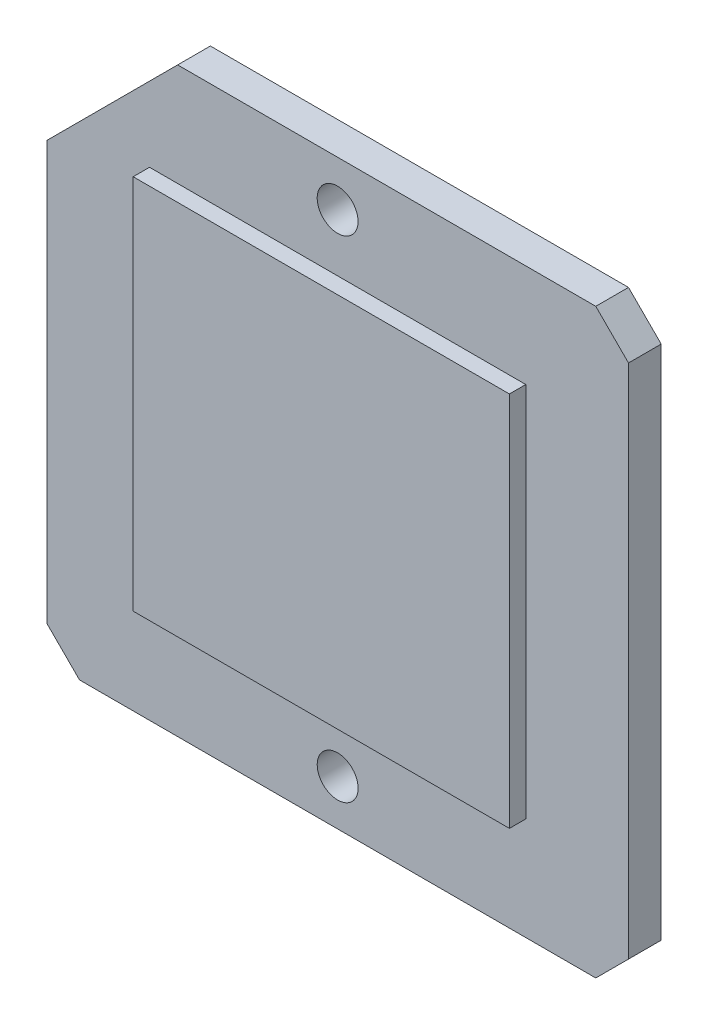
ISO-10303-21;
HEADER;
FILE_DESCRIPTION(('STEP AP214'),'2;1');
FILE_NAME('part.step','',(''),(''),'','','');
FILE_SCHEMA(('AUTOMOTIVE_DESIGN { 1 0 10303 214 1 1 1 1 }'));
ENDSEC;
DATA;
#1=APPLICATION_CONTEXT('core data for automotive mechanical design processes');
#2=APPLICATION_PROTOCOL_DEFINITION('international standard','automotive_design',2000,#1);
#3=PRODUCT_CONTEXT('',#1,'mechanical');
#4=PRODUCT('Part','Part','',(#3));
#5=PRODUCT_RELATED_PRODUCT_CATEGORY('part','',(#4));
#6=PRODUCT_DEFINITION_FORMATION('','',#4);
#7=PRODUCT_DEFINITION_CONTEXT('part definition',#1,'design');
#8=PRODUCT_DEFINITION('design','',#6,#7);
#9=PRODUCT_DEFINITION_SHAPE('','',#8);
#10=(LENGTH_UNIT() NAMED_UNIT(*) SI_UNIT(.MILLI.,.METRE.));
#11=(NAMED_UNIT(*) PLANE_ANGLE_UNIT() SI_UNIT($,.RADIAN.));
#12=(NAMED_UNIT(*) SI_UNIT($,.STERADIAN.) SOLID_ANGLE_UNIT());
#13=UNCERTAINTY_MEASURE_WITH_UNIT(LENGTH_MEASURE(1.E-05),#10,'distance_accuracy_value','');
#14=(GEOMETRIC_REPRESENTATION_CONTEXT(3) GLOBAL_UNCERTAINTY_ASSIGNED_CONTEXT((#13)) GLOBAL_UNIT_ASSIGNED_CONTEXT((#10,
#11,#12)) REPRESENTATION_CONTEXT('',''));
#15=CARTESIAN_POINT('',(0.,0.,0.));
#16=DIRECTION('',(0.,0.,1.));
#17=DIRECTION('',(1.,0.,0.));
#18=AXIS2_PLACEMENT_3D('',#15,#16,#17);
#19=CARTESIAN_POINT('',(-17.78,-17.78,2.));
#20=DIRECTION('',(0.,0.,1.));
#21=DIRECTION('',(1.,0.,0.));
#22=AXIS2_PLACEMENT_3D('',#19,#20,#21);
#23=PLANE('',#22);
#24=CARTESIAN_POINT('',(0.,-15.,2.));
#25=DIRECTION('',(0.,0.,1.));
#26=DIRECTION('',(-1.,0.,0.));
#27=AXIS2_PLACEMENT_3D('',#24,#25,#26);
#28=CIRCLE('',#27,1.25);
#29=CARTESIAN_POINT('',(-1.25,-15.,2.));
#30=VERTEX_POINT('',#29);
#31=EDGE_CURVE('E400',#30,#30,#28,.T.);
#32=ORIENTED_EDGE('',*,*,#31,.F.);
#33=EDGE_LOOP('',(#32));
#34=FACE_BOUND('',#33,.T.);
#35=CARTESIAN_POINT('',(0.,15.,2.));
#36=DIRECTION('',(0.,0.,1.));
#37=DIRECTION('',(1.,0.,0.));
#38=AXIS2_PLACEMENT_3D('',#35,#36,#37);
#39=CIRCLE('',#38,1.25);
#40=CARTESIAN_POINT('',(1.25,15.,2.));
#41=VERTEX_POINT('',#40);
#42=EDGE_CURVE('E402',#41,#41,#39,.T.);
#43=ORIENTED_EDGE('',*,*,#42,.F.);
#44=EDGE_LOOP('',(#43));
#45=FACE_BOUND('',#44,.T.);
#46=DIRECTION('',(-1.,0.,0.));
#47=VECTOR('',#46,1.);
#48=CARTESIAN_POINT('',(-17.78,17.78,2.));
#49=LINE('',#48,#47);
#50=CARTESIAN_POINT('',(15.78,17.78,2.));
#51=VERTEX_POINT('',#50);
#52=CARTESIAN_POINT('',(-9.77999999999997,17.78,2.));
#53=VERTEX_POINT('',#52);
#54=EDGE_CURVE('E181',#51,#53,#49,.T.);
#55=ORIENTED_EDGE('',*,*,#54,.T.);
#56=DIRECTION('',(0.707106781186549,0.707106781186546,0.));
#57=VECTOR('',#56,1.);
#58=CARTESIAN_POINT('',(-31.56,-3.99999999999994,2.));
#59=LINE('',#58,#57);
#60=CARTESIAN_POINT('',(-17.78,9.78000000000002,2.));
#61=VERTEX_POINT('',#60);
#62=EDGE_CURVE('E11',#53,#61,#59,.F.);
#63=ORIENTED_EDGE('',*,*,#62,.T.);
#64=DIRECTION('',(0.,-1.,0.));
#65=VECTOR('',#64,1.);
#66=CARTESIAN_POINT('',(-17.78,17.78,2.));
#67=LINE('',#66,#65);
#68=CARTESIAN_POINT('',(-17.78,-15.78,2.));
#69=VERTEX_POINT('',#68);
#70=EDGE_CURVE('E173',#61,#69,#67,.T.);
#71=ORIENTED_EDGE('',*,*,#70,.T.);
#72=DIRECTION('',(-0.707106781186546,0.707106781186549,0.));
#73=VECTOR('',#72,1.);
#74=CARTESIAN_POINT('',(-16.78,-16.78,2.));
#75=LINE('',#74,#73);
#76=CARTESIAN_POINT('',(-15.78,-17.78,2.));
#77=VERTEX_POINT('',#76);
#78=EDGE_CURVE('E202',#69,#77,#75,.F.);
#79=ORIENTED_EDGE('',*,*,#78,.T.);
#80=DIRECTION('',(1.,0.,0.));
#81=VECTOR('',#80,1.);
#82=CARTESIAN_POINT('',(-17.78,-17.78,2.));
#83=LINE('',#82,#81);
#84=CARTESIAN_POINT('',(15.78,-17.78,2.));
#85=VERTEX_POINT('',#84);
#86=EDGE_CURVE('E175',#77,#85,#83,.T.);
#87=ORIENTED_EDGE('',*,*,#86,.T.);
#88=DIRECTION('',(-0.707106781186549,-0.707106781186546,0.));
#89=VECTOR('',#88,1.);
#90=CARTESIAN_POINT('',(-1.00000000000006,-34.56,2.));
#91=LINE('',#90,#89);
#92=CARTESIAN_POINT('',(17.78,-15.78,2.));
#93=VERTEX_POINT('',#92);
#94=EDGE_CURVE('E198',#85,#93,#91,.F.);
#95=ORIENTED_EDGE('',*,*,#94,.T.);
#96=DIRECTION('',(0.,1.,0.));
#97=VECTOR('',#96,1.);
#98=CARTESIAN_POINT('',(17.78,17.78,2.));
#99=LINE('',#98,#97);
#100=CARTESIAN_POINT('',(17.78,15.78,2.));
#101=VERTEX_POINT('',#100);
#102=EDGE_CURVE('E178',#93,#101,#99,.T.);
#103=ORIENTED_EDGE('',*,*,#102,.T.);
#104=DIRECTION('',(0.707106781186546,-0.707106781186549,0.));
#105=VECTOR('',#104,1.);
#106=CARTESIAN_POINT('',(16.7800000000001,16.7799999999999,2.));
#107=LINE('',#106,#105);
#108=EDGE_CURVE('E200',#101,#51,#107,.F.);
#109=ORIENTED_EDGE('',*,*,#108,.T.);
#110=EDGE_LOOP('',(#55,#63,#71,#79,#87,#95,#103,#109));
#111=FACE_BOUND('',#110,.T.);
#112=DIRECTION('',(1.,0.,0.));
#113=VECTOR('',#112,1.);
#114=CARTESIAN_POINT('',(-11.5,-11.5,2.));
#115=LINE('',#114,#113);
#116=CARTESIAN_POINT('',(-11.5,-11.5,2.));
#117=VERTEX_POINT('',#116);
#118=CARTESIAN_POINT('',(11.5,-11.5,2.));
#119=VERTEX_POINT('',#118);
#120=EDGE_CURVE('E125',#117,#119,#115,.T.);
#121=ORIENTED_EDGE('',*,*,#120,.F.);
#122=DIRECTION('',(0.,-1.,0.));
#123=VECTOR('',#122,1.);
#124=CARTESIAN_POINT('',(-11.5,11.5,2.));
#125=LINE('',#124,#123);
#126=CARTESIAN_POINT('',(-11.5,11.5,2.));
#127=VERTEX_POINT('',#126);
#128=EDGE_CURVE('E136',#127,#117,#125,.T.);
#129=ORIENTED_EDGE('',*,*,#128,.F.);
#130=DIRECTION('',(-1.,0.,0.));
#131=VECTOR('',#130,1.);
#132=CARTESIAN_POINT('',(-11.5,11.5,2.));
#133=LINE('',#132,#131);
#134=CARTESIAN_POINT('',(11.5,11.5,2.));
#135=VERTEX_POINT('',#134);
#136=EDGE_CURVE('E148',#135,#127,#133,.T.);
#137=ORIENTED_EDGE('',*,*,#136,.F.);
#138=DIRECTION('',(0.,1.,0.));
#139=VECTOR('',#138,1.);
#140=CARTESIAN_POINT('',(11.5,11.5,2.));
#141=LINE('',#140,#139);
#142=EDGE_CURVE('E146',#119,#135,#141,.T.);
#143=ORIENTED_EDGE('',*,*,#142,.F.);
#144=EDGE_LOOP('',(#121,#129,#137,#143));
#145=FACE_BOUND('',#144,.T.);
#146=ADVANCED_FACE('F32',(#34,#45,#111,#145),#23,.T.);
#147=CARTESIAN_POINT('',(-17.78,17.78,2.));
#148=DIRECTION('',(1.,0.,0.));
#149=DIRECTION('',(0.,1.,0.));
#150=AXIS2_PLACEMENT_3D('',#147,#148,#149);
#151=PLANE('',#150);
#152=ORIENTED_EDGE('',*,*,#70,.F.);
#153=DIRECTION('',(0.,0.,-1.));
#154=VECTOR('',#153,1.);
#155=CARTESIAN_POINT('',(-17.78,9.78000000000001,2.));
#156=LINE('',#155,#154);
#157=CARTESIAN_POINT('',(-17.78,9.78000000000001,0.));
#158=VERTEX_POINT('',#157);
#159=EDGE_CURVE('E212',#61,#158,#156,.T.);
#160=ORIENTED_EDGE('',*,*,#159,.T.);
#161=DIRECTION('',(0.,-1.,0.));
#162=VECTOR('',#161,1.);
#163=CARTESIAN_POINT('',(-17.78,17.78,0.));
#164=LINE('',#163,#162);
#165=CARTESIAN_POINT('',(-17.78,-15.78,0.));
#166=VERTEX_POINT('',#165);
#167=EDGE_CURVE('E131',#158,#166,#164,.T.);
#168=ORIENTED_EDGE('',*,*,#167,.T.);
#169=DIRECTION('',(0.,0.,1.));
#170=VECTOR('',#169,1.);
#171=CARTESIAN_POINT('',(-17.78,-15.78,2.));
#172=LINE('',#171,#170);
#173=EDGE_CURVE('E195',#166,#69,#172,.T.);
#174=ORIENTED_EDGE('',*,*,#173,.T.);
#175=EDGE_LOOP('',(#152,#160,#168,#174));
#176=FACE_BOUND('',#175,.T.);
#177=ADVANCED_FACE('F34',(#176),#151,.F.);
#178=CARTESIAN_POINT('',(-17.78,-17.78,2.));
#179=DIRECTION('',(0.,1.,0.));
#180=DIRECTION('',(0.,0.,1.));
#181=AXIS2_PLACEMENT_3D('',#178,#179,#180);
#182=PLANE('',#181);
#183=ORIENTED_EDGE('',*,*,#86,.F.);
#184=DIRECTION('',(0.,0.,-1.));
#185=VECTOR('',#184,1.);
#186=CARTESIAN_POINT('',(-15.78,-17.78,2.));
#187=LINE('',#186,#185);
#188=CARTESIAN_POINT('',(-15.78,-17.78,0.));
#189=VERTEX_POINT('',#188);
#190=EDGE_CURVE('E185',#77,#189,#187,.T.);
#191=ORIENTED_EDGE('',*,*,#190,.T.);
#192=DIRECTION('',(1.,0.,0.));
#193=VECTOR('',#192,1.);
#194=CARTESIAN_POINT('',(-17.78,-17.78,0.));
#195=LINE('',#194,#193);
#196=CARTESIAN_POINT('',(15.78,-17.78,0.));
#197=VERTEX_POINT('',#196);
#198=EDGE_CURVE('E165',#189,#197,#195,.T.);
#199=ORIENTED_EDGE('',*,*,#198,.T.);
#200=DIRECTION('',(0.,0.,1.));
#201=VECTOR('',#200,1.);
#202=CARTESIAN_POINT('',(15.78,-17.78,2.));
#203=LINE('',#202,#201);
#204=EDGE_CURVE('E183',#197,#85,#203,.T.);
#205=ORIENTED_EDGE('',*,*,#204,.T.);
#206=EDGE_LOOP('',(#183,#191,#199,#205));
#207=FACE_BOUND('',#206,.T.);
#208=ADVANCED_FACE('F231',(#207),#182,.F.);
#209=CARTESIAN_POINT('',(17.78,17.78,2.));
#210=DIRECTION('',(-1.,0.,0.));
#211=DIRECTION('',(0.,-1.,0.));
#212=AXIS2_PLACEMENT_3D('',#209,#210,#211);
#213=PLANE('',#212);
#214=DIRECTION('',(0.,1.,0.));
#215=VECTOR('',#214,1.);
#216=CARTESIAN_POINT('',(17.78,17.78,0.));
#217=LINE('',#216,#215);
#218=CARTESIAN_POINT('',(17.78,-15.78,0.));
#219=VERTEX_POINT('',#218);
#220=CARTESIAN_POINT('',(17.78,15.78,0.));
#221=VERTEX_POINT('',#220);
#222=EDGE_CURVE('E168',#219,#221,#217,.T.);
#223=ORIENTED_EDGE('',*,*,#222,.T.);
#224=DIRECTION('',(0.,0.,1.));
#225=VECTOR('',#224,1.);
#226=CARTESIAN_POINT('',(17.78,15.78,2.));
#227=LINE('',#226,#225);
#228=EDGE_CURVE('E210',#221,#101,#227,.T.);
#229=ORIENTED_EDGE('',*,*,#228,.T.);
#230=ORIENTED_EDGE('',*,*,#102,.F.);
#231=DIRECTION('',(0.,0.,-1.));
#232=VECTOR('',#231,1.);
#233=CARTESIAN_POINT('',(17.78,-15.78,2.));
#234=LINE('',#233,#232);
#235=EDGE_CURVE('E207',#93,#219,#234,.T.);
#236=ORIENTED_EDGE('',*,*,#235,.T.);
#237=EDGE_LOOP('',(#223,#229,#230,#236));
#238=FACE_BOUND('',#237,.T.);
#239=ADVANCED_FACE('F239',(#238),#213,.F.);
#240=CARTESIAN_POINT('',(-17.78,17.78,2.));
#241=DIRECTION('',(0.,-1.,0.));
#242=DIRECTION('',(0.,0.,-1.));
#243=AXIS2_PLACEMENT_3D('',#240,#241,#242);
#244=PLANE('',#243);
#245=DIRECTION('',(-1.,0.,0.));
#246=VECTOR('',#245,1.);
#247=CARTESIAN_POINT('',(-17.78,17.78,0.));
#248=LINE('',#247,#246);
#249=CARTESIAN_POINT('',(15.78,17.78,0.));
#250=VERTEX_POINT('',#249);
#251=CARTESIAN_POINT('',(-9.77999999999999,17.78,0.));
#252=VERTEX_POINT('',#251);
#253=EDGE_CURVE('E171',#250,#252,#248,.T.);
#254=ORIENTED_EDGE('',*,*,#253,.T.);
#255=DIRECTION('',(0.,0.,1.));
#256=VECTOR('',#255,1.);
#257=CARTESIAN_POINT('',(-9.77999999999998,17.78,2.));
#258=LINE('',#257,#256);
#259=EDGE_CURVE('E40',#252,#53,#258,.T.);
#260=ORIENTED_EDGE('',*,*,#259,.T.);
#261=ORIENTED_EDGE('',*,*,#54,.F.);
#262=DIRECTION('',(0.,0.,-1.));
#263=VECTOR('',#262,1.);
#264=CARTESIAN_POINT('',(15.78,17.78,2.));
#265=LINE('',#264,#263);
#266=EDGE_CURVE('E204',#51,#250,#265,.T.);
#267=ORIENTED_EDGE('',*,*,#266,.T.);
#268=EDGE_LOOP('',(#254,#260,#261,#267));
#269=FACE_BOUND('',#268,.T.);
#270=ADVANCED_FACE('F245',(#269),#244,.F.);
#271=CARTESIAN_POINT('',(-17.78,-17.78,0.));
#272=DIRECTION('',(0.,0.,1.));
#273=DIRECTION('',(1.,0.,0.));
#274=AXIS2_PLACEMENT_3D('',#271,#272,#273);
#275=PLANE('',#274);
#276=CARTESIAN_POINT('',(0.,-15.,0.));
#277=DIRECTION('',(0.,0.,1.));
#278=DIRECTION('',(-1.,0.,0.));
#279=AXIS2_PLACEMENT_3D('',#276,#277,#278);
#280=CIRCLE('',#279,1.25);
#281=CARTESIAN_POINT('',(-1.25,-15.,0.));
#282=VERTEX_POINT('',#281);
#283=EDGE_CURVE('E398',#282,#282,#280,.T.);
#284=ORIENTED_EDGE('',*,*,#283,.T.);
#285=EDGE_LOOP('',(#284));
#286=FACE_BOUND('',#285,.T.);
#287=CARTESIAN_POINT('',(0.,15.,0.));
#288=DIRECTION('',(0.,0.,1.));
#289=DIRECTION('',(1.,0.,0.));
#290=AXIS2_PLACEMENT_3D('',#287,#288,#289);
#291=CIRCLE('',#290,1.25);
#292=CARTESIAN_POINT('',(1.25,15.,0.));
#293=VERTEX_POINT('',#292);
#294=EDGE_CURVE('E142',#293,#293,#291,.T.);
#295=ORIENTED_EDGE('',*,*,#294,.T.);
#296=EDGE_LOOP('',(#295));
#297=FACE_BOUND('',#296,.T.);
#298=ORIENTED_EDGE('',*,*,#167,.F.);
#299=DIRECTION('',(-0.707106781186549,-0.707106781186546,0.));
#300=VECTOR('',#299,1.);
#301=CARTESIAN_POINT('',(-17.78,9.78000000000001,0.));
#302=LINE('',#301,#300);
#303=EDGE_CURVE('E54',#158,#252,#302,.F.);
#304=ORIENTED_EDGE('',*,*,#303,.T.);
#305=ORIENTED_EDGE('',*,*,#253,.F.);
#306=DIRECTION('',(-0.707106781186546,0.707106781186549,0.));
#307=VECTOR('',#306,1.);
#308=CARTESIAN_POINT('',(15.78,17.78,0.));
#309=LINE('',#308,#307);
#310=EDGE_CURVE('E190',#250,#221,#309,.F.);
#311=ORIENTED_EDGE('',*,*,#310,.T.);
#312=ORIENTED_EDGE('',*,*,#222,.F.);
#313=DIRECTION('',(0.707106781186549,0.707106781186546,0.));
#314=VECTOR('',#313,1.);
#315=CARTESIAN_POINT('',(17.78,-15.78,0.));
#316=LINE('',#315,#314);
#317=EDGE_CURVE('E188',#219,#197,#316,.F.);
#318=ORIENTED_EDGE('',*,*,#317,.T.);
#319=ORIENTED_EDGE('',*,*,#198,.F.);
#320=DIRECTION('',(0.707106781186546,-0.707106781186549,0.));
#321=VECTOR('',#320,1.);
#322=CARTESIAN_POINT('',(-15.78,-17.78,0.));
#323=LINE('',#322,#321);
#324=EDGE_CURVE('E192',#189,#166,#323,.F.);
#325=ORIENTED_EDGE('',*,*,#324,.T.);
#326=EDGE_LOOP('',(#298,#304,#305,#311,#312,#318,#319,#325));
#327=FACE_BOUND('',#326,.T.);
#328=ADVANCED_FACE('F220',(#286,#297,#327),#275,.F.);
#329=CARTESIAN_POINT('',(-11.5,11.5,3.));
#330=DIRECTION('',(1.,0.,0.));
#331=DIRECTION('',(0.,1.,0.));
#332=AXIS2_PLACEMENT_3D('',#329,#330,#331);
#333=PLANE('',#332);
#334=ORIENTED_EDGE('',*,*,#128,.T.);
#335=DIRECTION('',(0.,0.,-1.));
#336=VECTOR('',#335,1.);
#337=CARTESIAN_POINT('',(-11.5,-11.5,3.));
#338=LINE('',#337,#336);
#339=CARTESIAN_POINT('',(-11.5,-11.5,3.));
#340=VERTEX_POINT('',#339);
#341=EDGE_CURVE('E120',#340,#117,#338,.T.);
#342=ORIENTED_EDGE('',*,*,#341,.F.);
#343=DIRECTION('',(0.,-1.,0.));
#344=VECTOR('',#343,1.);
#345=CARTESIAN_POINT('',(-11.5,11.5,3.));
#346=LINE('',#345,#344);
#347=CARTESIAN_POINT('',(-11.5,11.5,3.));
#348=VERTEX_POINT('',#347);
#349=EDGE_CURVE('E153',#348,#340,#346,.T.);
#350=ORIENTED_EDGE('',*,*,#349,.F.);
#351=DIRECTION('',(0.,0.,-1.));
#352=VECTOR('',#351,1.);
#353=CARTESIAN_POINT('',(-11.5,11.5,3.));
#354=LINE('',#353,#352);
#355=EDGE_CURVE('E139',#348,#127,#354,.T.);
#356=ORIENTED_EDGE('',*,*,#355,.T.);
#357=EDGE_LOOP('',(#334,#342,#350,#356));
#358=FACE_BOUND('',#357,.T.);
#359=ADVANCED_FACE('F137',(#358),#333,.F.);
#360=CARTESIAN_POINT('',(-11.5,-11.5,3.));
#361=DIRECTION('',(0.,1.,0.));
#362=DIRECTION('',(0.,0.,1.));
#363=AXIS2_PLACEMENT_3D('',#360,#361,#362);
#364=PLANE('',#363);
#365=ORIENTED_EDGE('',*,*,#120,.T.);
#366=DIRECTION('',(0.,0.,-1.));
#367=VECTOR('',#366,1.);
#368=CARTESIAN_POINT('',(11.5,-11.5,3.));
#369=LINE('',#368,#367);
#370=CARTESIAN_POINT('',(11.5,-11.5,3.));
#371=VERTEX_POINT('',#370);
#372=EDGE_CURVE('E132',#371,#119,#369,.T.);
#373=ORIENTED_EDGE('',*,*,#372,.F.);
#374=DIRECTION('',(1.,0.,0.));
#375=VECTOR('',#374,1.);
#376=CARTESIAN_POINT('',(-11.5,-11.5,3.));
#377=LINE('',#376,#375);
#378=EDGE_CURVE('E127',#340,#371,#377,.T.);
#379=ORIENTED_EDGE('',*,*,#378,.F.);
#380=ORIENTED_EDGE('',*,*,#341,.T.);
#381=EDGE_LOOP('',(#365,#373,#379,#380));
#382=FACE_BOUND('',#381,.T.);
#383=ADVANCED_FACE('F122',(#382),#364,.F.);
#384=CARTESIAN_POINT('',(11.5,11.5,3.));
#385=DIRECTION('',(-1.,0.,0.));
#386=DIRECTION('',(0.,-1.,0.));
#387=AXIS2_PLACEMENT_3D('',#384,#385,#386);
#388=PLANE('',#387);
#389=ORIENTED_EDGE('',*,*,#142,.T.);
#390=DIRECTION('',(0.,0.,-1.));
#391=VECTOR('',#390,1.);
#392=CARTESIAN_POINT('',(11.5,11.5,3.));
#393=LINE('',#392,#391);
#394=CARTESIAN_POINT('',(11.5,11.5,3.));
#395=VERTEX_POINT('',#394);
#396=EDGE_CURVE('E161',#395,#135,#393,.T.);
#397=ORIENTED_EDGE('',*,*,#396,.F.);
#398=DIRECTION('',(0.,1.,0.));
#399=VECTOR('',#398,1.);
#400=CARTESIAN_POINT('',(11.5,11.5,3.));
#401=LINE('',#400,#399);
#402=EDGE_CURVE('E156',#371,#395,#401,.T.);
#403=ORIENTED_EDGE('',*,*,#402,.F.);
#404=ORIENTED_EDGE('',*,*,#372,.T.);
#405=EDGE_LOOP('',(#389,#397,#403,#404));
#406=FACE_BOUND('',#405,.T.);
#407=ADVANCED_FACE('F305',(#406),#388,.F.);
#408=CARTESIAN_POINT('',(-11.5,11.5,3.));
#409=DIRECTION('',(0.,-1.,0.));
#410=DIRECTION('',(1.,0.,0.));
#411=AXIS2_PLACEMENT_3D('',#408,#409,#410);
#412=PLANE('',#411);
#413=ORIENTED_EDGE('',*,*,#136,.T.);
#414=ORIENTED_EDGE('',*,*,#355,.F.);
#415=DIRECTION('',(-1.,0.,0.));
#416=VECTOR('',#415,1.);
#417=CARTESIAN_POINT('',(-11.5,11.5,3.));
#418=LINE('',#417,#416);
#419=EDGE_CURVE('E158',#395,#348,#418,.T.);
#420=ORIENTED_EDGE('',*,*,#419,.F.);
#421=ORIENTED_EDGE('',*,*,#396,.T.);
#422=EDGE_LOOP('',(#413,#414,#420,#421));
#423=FACE_BOUND('',#422,.T.);
#424=ADVANCED_FACE('F312',(#423),#412,.F.);
#425=CARTESIAN_POINT('',(-11.5,-11.5,3.));
#426=DIRECTION('',(0.,0.,1.));
#427=DIRECTION('',(1.,0.,0.));
#428=AXIS2_PLACEMENT_3D('',#425,#426,#427);
#429=PLANE('',#428);
#430=ORIENTED_EDGE('',*,*,#349,.T.);
#431=ORIENTED_EDGE('',*,*,#378,.T.);
#432=ORIENTED_EDGE('',*,*,#402,.T.);
#433=ORIENTED_EDGE('',*,*,#419,.T.);
#434=EDGE_LOOP('',(#430,#431,#432,#433));
#435=FACE_BOUND('',#434,.T.);
#436=ADVANCED_FACE('F320',(#435),#429,.T.);
#437=CARTESIAN_POINT('',(-15.78,-17.78,2.));
#438=DIRECTION('',(0.707106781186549,0.707106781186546,0.));
#439=DIRECTION('',(-0.707106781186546,0.707106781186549,0.));
#440=AXIS2_PLACEMENT_3D('',#437,#438,#439);
#441=PLANE('',#440);
#442=ORIENTED_EDGE('',*,*,#78,.F.);
#443=ORIENTED_EDGE('',*,*,#173,.F.);
#444=ORIENTED_EDGE('',*,*,#324,.F.);
#445=ORIENTED_EDGE('',*,*,#190,.F.);
#446=EDGE_LOOP('',(#442,#443,#444,#445));
#447=FACE_BOUND('',#446,.T.);
#448=ADVANCED_FACE('F226',(#447),#441,.F.);
#449=CARTESIAN_POINT('',(15.78,17.78,2.));
#450=DIRECTION('',(-0.707106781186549,-0.707106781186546,0.));
#451=DIRECTION('',(0.707106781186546,-0.707106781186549,0.));
#452=AXIS2_PLACEMENT_3D('',#449,#450,#451);
#453=PLANE('',#452);
#454=ORIENTED_EDGE('',*,*,#108,.F.);
#455=ORIENTED_EDGE('',*,*,#228,.F.);
#456=ORIENTED_EDGE('',*,*,#310,.F.);
#457=ORIENTED_EDGE('',*,*,#266,.F.);
#458=EDGE_LOOP('',(#454,#455,#456,#457));
#459=FACE_BOUND('',#458,.T.);
#460=ADVANCED_FACE('F243',(#459),#453,.F.);
#461=CARTESIAN_POINT('',(17.78,-15.78,2.));
#462=DIRECTION('',(-0.707106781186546,0.707106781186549,0.));
#463=DIRECTION('',(-0.707106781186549,-0.707106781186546,0.));
#464=AXIS2_PLACEMENT_3D('',#461,#462,#463);
#465=PLANE('',#464);
#466=ORIENTED_EDGE('',*,*,#94,.F.);
#467=ORIENTED_EDGE('',*,*,#204,.F.);
#468=ORIENTED_EDGE('',*,*,#317,.F.);
#469=ORIENTED_EDGE('',*,*,#235,.F.);
#470=EDGE_LOOP('',(#466,#467,#468,#469));
#471=FACE_BOUND('',#470,.T.);
#472=ADVANCED_FACE('F234',(#471),#465,.F.);
#473=CARTESIAN_POINT('',(-17.78,9.78000000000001,2.));
#474=DIRECTION('',(0.707106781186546,-0.707106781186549,0.));
#475=DIRECTION('',(0.707106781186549,0.707106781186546,0.));
#476=AXIS2_PLACEMENT_3D('',#473,#474,#475);
#477=PLANE('',#476);
#478=ORIENTED_EDGE('',*,*,#62,.F.);
#479=ORIENTED_EDGE('',*,*,#259,.F.);
#480=ORIENTED_EDGE('',*,*,#303,.F.);
#481=ORIENTED_EDGE('',*,*,#159,.F.);
#482=EDGE_LOOP('',(#478,#479,#480,#481));
#483=FACE_BOUND('',#482,.T.);
#484=ADVANCED_FACE('F246',(#483),#477,.F.);
#485=CARTESIAN_POINT('',(0.,15.,0.));
#486=DIRECTION('',(0.,0.,1.));
#487=DIRECTION('',(1.,0.,0.));
#488=AXIS2_PLACEMENT_3D('',#485,#486,#487);
#489=CYLINDRICAL_SURFACE('',#488,1.25);
#490=ORIENTED_EDGE('',*,*,#294,.F.);
#491=EDGE_LOOP('',(#490));
#492=FACE_BOUND('',#491,.T.);
#493=ORIENTED_EDGE('',*,*,#42,.T.);
#494=EDGE_LOOP('',(#493));
#495=FACE_BOUND('',#494,.T.);
#496=ADVANCED_FACE('F248',(#492,#495),#489,.F.);
#497=CARTESIAN_POINT('',(0.,-15.,0.));
#498=DIRECTION('',(0.,0.,1.));
#499=DIRECTION('',(1.,0.,0.));
#500=AXIS2_PLACEMENT_3D('',#497,#498,#499);
#501=CYLINDRICAL_SURFACE('',#500,1.25);
#502=ORIENTED_EDGE('',*,*,#283,.F.);
#503=EDGE_LOOP('',(#502));
#504=FACE_BOUND('',#503,.T.);
#505=ORIENTED_EDGE('',*,*,#31,.T.);
#506=EDGE_LOOP('',(#505));
#507=FACE_BOUND('',#506,.T.);
#508=ADVANCED_FACE('F254',(#504,#507),#501,.F.);
#509=CLOSED_SHELL('',(#146,#177,#208,#239,#270,#328,#359,#383,#407,#424,#436,#448,#460,#472,
#484,#496,#508));
#510=MANIFOLD_SOLID_BREP('B2',#509);
#511=ADVANCED_BREP_SHAPE_REPRESENTATION('',(#18,#510),#14);
#512=SHAPE_DEFINITION_REPRESENTATION(#9,#511);
ENDSEC;
END-ISO-10303-21;
